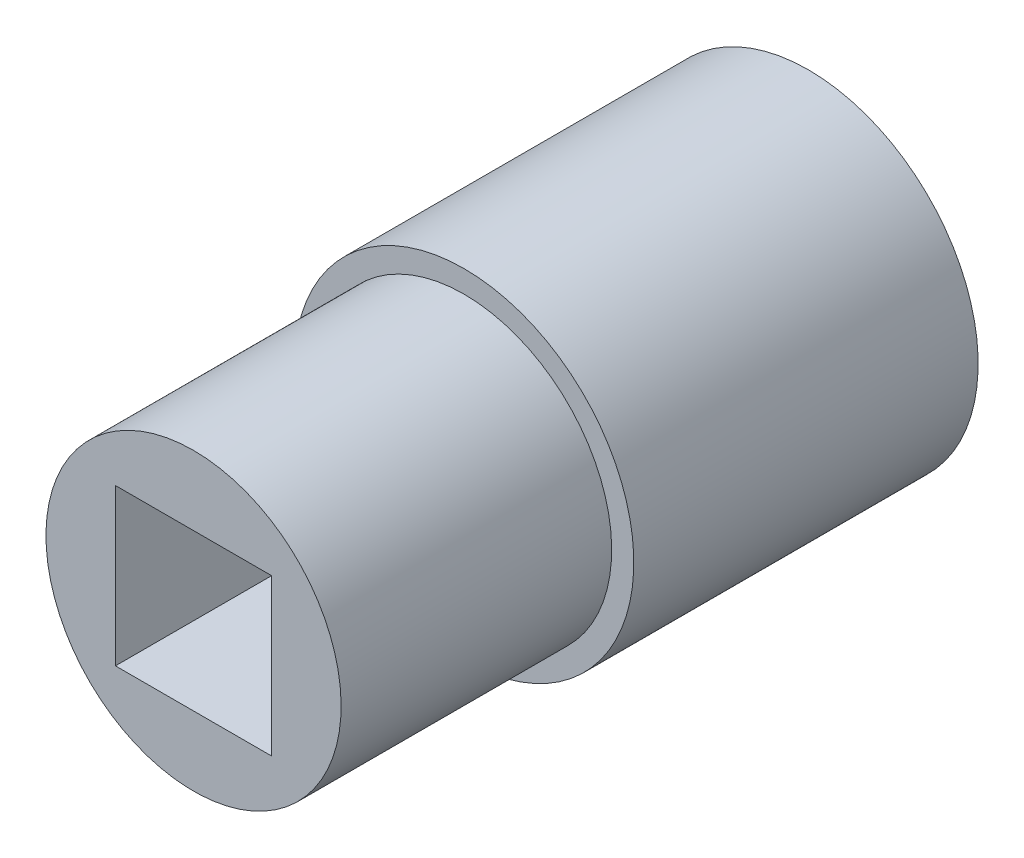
ISO-10303-21;
HEADER;
FILE_DESCRIPTION(('STEP AP214'),'2;1');
FILE_NAME('part.step','',(''),(''),'','','');
FILE_SCHEMA(('AUTOMOTIVE_DESIGN { 1 0 10303 214 1 1 1 1 }'));
ENDSEC;
DATA;
#1=APPLICATION_CONTEXT('core data for automotive mechanical design processes');
#2=APPLICATION_PROTOCOL_DEFINITION('international standard','automotive_design',2000,#1);
#3=PRODUCT_CONTEXT('',#1,'mechanical');
#4=PRODUCT('Part','Part','',(#3));
#5=PRODUCT_RELATED_PRODUCT_CATEGORY('part','',(#4));
#6=PRODUCT_DEFINITION_FORMATION('','',#4);
#7=PRODUCT_DEFINITION_CONTEXT('part definition',#1,'design');
#8=PRODUCT_DEFINITION('design','',#6,#7);
#9=PRODUCT_DEFINITION_SHAPE('','',#8);
#10=(LENGTH_UNIT() NAMED_UNIT(*) SI_UNIT(.MILLI.,.METRE.));
#11=(NAMED_UNIT(*) PLANE_ANGLE_UNIT() SI_UNIT($,.RADIAN.));
#12=(NAMED_UNIT(*) SI_UNIT($,.STERADIAN.) SOLID_ANGLE_UNIT());
#13=UNCERTAINTY_MEASURE_WITH_UNIT(LENGTH_MEASURE(1.E-05),#10,'distance_accuracy_value','');
#14=(GEOMETRIC_REPRESENTATION_CONTEXT(3) GLOBAL_UNCERTAINTY_ASSIGNED_CONTEXT((#13)) GLOBAL_UNIT_ASSIGNED_CONTEXT((#10,
#11,#12)) REPRESENTATION_CONTEXT('',''));
#15=CARTESIAN_POINT('',(0.,0.,0.));
#16=DIRECTION('',(0.,0.,1.));
#17=DIRECTION('',(1.,0.,0.));
#18=AXIS2_PLACEMENT_3D('',#15,#16,#17);
#19=CARTESIAN_POINT('',(0.,0.,0.));
#20=DIRECTION('',(0.,0.,-1.));
#21=DIRECTION('',(0.,1.,0.));
#22=AXIS2_PLACEMENT_3D('',#19,#20,#21);
#23=PLANE('',#22);
#24=DIRECTION('',(0.866025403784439,-0.5,0.));
#25=VECTOR('',#24,1.);
#26=CARTESIAN_POINT('',(0.,5.77350269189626,0.));
#27=LINE('',#26,#25);
#28=CARTESIAN_POINT('',(0.,5.77350269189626,0.));
#29=VERTEX_POINT('',#28);
#30=CARTESIAN_POINT('',(5.,2.88675134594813,0.));
#31=VERTEX_POINT('',#30);
#32=EDGE_CURVE('E36',#29,#31,#27,.T.);
#33=ORIENTED_EDGE('',*,*,#32,.F.);
#34=DIRECTION('',(0.866025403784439,0.5,0.));
#35=VECTOR('',#34,1.);
#36=CARTESIAN_POINT('',(-5.,2.88675134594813,0.));
#37=LINE('',#36,#35);
#38=CARTESIAN_POINT('',(-5.,2.88675134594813,0.));
#39=VERTEX_POINT('',#38);
#40=EDGE_CURVE('E132',#39,#29,#37,.T.);
#41=ORIENTED_EDGE('',*,*,#40,.F.);
#42=DIRECTION('',(0.,1.,0.));
#43=VECTOR('',#42,1.);
#44=CARTESIAN_POINT('',(-5.,-2.88675134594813,0.));
#45=LINE('',#44,#43);
#46=CARTESIAN_POINT('',(-5.,-2.88675134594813,0.));
#47=VERTEX_POINT('',#46);
#48=EDGE_CURVE('E158',#47,#39,#45,.T.);
#49=ORIENTED_EDGE('',*,*,#48,.F.);
#50=DIRECTION('',(-0.866025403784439,0.5,0.));
#51=VECTOR('',#50,1.);
#52=CARTESIAN_POINT('',(0.,-5.77350269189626,0.));
#53=LINE('',#52,#51);
#54=CARTESIAN_POINT('',(0.,-5.77350269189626,0.));
#55=VERTEX_POINT('',#54);
#56=EDGE_CURVE('E155',#55,#47,#53,.T.);
#57=ORIENTED_EDGE('',*,*,#56,.F.);
#58=DIRECTION('',(-0.866025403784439,-0.5,0.));
#59=VECTOR('',#58,1.);
#60=CARTESIAN_POINT('',(5.,-2.88675134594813,0.));
#61=LINE('',#60,#59);
#62=CARTESIAN_POINT('',(5.,-2.88675134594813,0.));
#63=VERTEX_POINT('',#62);
#64=EDGE_CURVE('E152',#63,#55,#61,.T.);
#65=ORIENTED_EDGE('',*,*,#64,.F.);
#66=DIRECTION('',(0.,-1.,0.));
#67=VECTOR('',#66,1.);
#68=CARTESIAN_POINT('',(5.,2.88675134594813,0.));
#69=LINE('',#68,#67);
#70=EDGE_CURVE('E149',#31,#63,#69,.T.);
#71=ORIENTED_EDGE('',*,*,#70,.F.);
#72=EDGE_LOOP('',(#33,#41,#49,#57,#65,#71));
#73=FACE_BOUND('',#72,.T.);
#74=CARTESIAN_POINT('',(0.,0.,0.));
#75=DIRECTION('',(0.,0.,-1.));
#76=DIRECTION('',(0.,1.,0.));
#77=AXIS2_PLACEMENT_3D('',#74,#75,#76);
#78=CIRCLE('',#77,6.9);
#79=CARTESIAN_POINT('',(0.,6.9,0.));
#80=VERTEX_POINT('',#79);
#81=EDGE_CURVE('E9',#80,#80,#78,.T.);
#82=ORIENTED_EDGE('',*,*,#81,.T.);
#83=EDGE_LOOP('',(#82));
#84=FACE_BOUND('',#83,.T.);
#85=ADVANCED_FACE('F14',(#73,#84),#23,.T.);
#86=CARTESIAN_POINT('',(0.,0.,0.));
#87=DIRECTION('',(0.,0.,-1.));
#88=DIRECTION('',(0.,1.,0.));
#89=AXIS2_PLACEMENT_3D('',#86,#87,#88);
#90=CYLINDRICAL_SURFACE('',#89,6.9);
#91=CARTESIAN_POINT('',(0.,0.,14.));
#92=DIRECTION('',(0.,0.,-1.));
#93=DIRECTION('',(0.,1.,0.));
#94=AXIS2_PLACEMENT_3D('',#91,#92,#93);
#95=CIRCLE('',#94,6.9);
#96=CARTESIAN_POINT('',(0.,6.9,14.));
#97=VERTEX_POINT('',#96);
#98=EDGE_CURVE('E21',#97,#97,#95,.T.);
#99=ORIENTED_EDGE('',*,*,#98,.T.);
#100=EDGE_LOOP('',(#99));
#101=FACE_BOUND('',#100,.T.);
#102=ORIENTED_EDGE('',*,*,#81,.F.);
#103=EDGE_LOOP('',(#102));
#104=FACE_BOUND('',#103,.T.);
#105=ADVANCED_FACE('F182',(#101,#104),#90,.T.);
#106=CARTESIAN_POINT('',(6.,0.,14.));
#107=DIRECTION('',(0.,0.,1.));
#108=DIRECTION('',(0.,-1.,0.));
#109=AXIS2_PLACEMENT_3D('',#106,#107,#108);
#110=PLANE('',#109);
#111=CARTESIAN_POINT('',(0.,0.,14.));
#112=DIRECTION('',(0.,0.,-1.));
#113=DIRECTION('',(0.,1.,0.));
#114=AXIS2_PLACEMENT_3D('',#111,#112,#113);
#115=CIRCLE('',#114,6.);
#116=CARTESIAN_POINT('',(0.,6.,14.));
#117=VERTEX_POINT('',#116);
#118=EDGE_CURVE('E177',#117,#117,#115,.T.);
#119=ORIENTED_EDGE('',*,*,#118,.T.);
#120=EDGE_LOOP('',(#119));
#121=FACE_BOUND('',#120,.T.);
#122=ORIENTED_EDGE('',*,*,#98,.F.);
#123=EDGE_LOOP('',(#122));
#124=FACE_BOUND('',#123,.T.);
#125=ADVANCED_FACE('F185',(#121,#124),#110,.T.);
#126=CARTESIAN_POINT('',(0.,0.,0.));
#127=DIRECTION('',(0.,0.,-1.));
#128=DIRECTION('',(0.,1.,0.));
#129=AXIS2_PLACEMENT_3D('',#126,#127,#128);
#130=CYLINDRICAL_SURFACE('',#129,6.);
#131=CARTESIAN_POINT('',(0.,0.,25.));
#132=DIRECTION('',(0.,0.,-1.));
#133=DIRECTION('',(0.,1.,0.));
#134=AXIS2_PLACEMENT_3D('',#131,#132,#133);
#135=CIRCLE('',#134,6.);
#136=CARTESIAN_POINT('',(0.,6.,25.));
#137=VERTEX_POINT('',#136);
#138=EDGE_CURVE('E165',#137,#137,#135,.T.);
#139=ORIENTED_EDGE('',*,*,#138,.T.);
#140=EDGE_LOOP('',(#139));
#141=FACE_BOUND('',#140,.T.);
#142=ORIENTED_EDGE('',*,*,#118,.F.);
#143=EDGE_LOOP('',(#142));
#144=FACE_BOUND('',#143,.T.);
#145=ADVANCED_FACE('F187',(#141,#144),#130,.T.);
#146=CARTESIAN_POINT('',(6.,0.,25.));
#147=DIRECTION('',(0.,0.,1.));
#148=DIRECTION('',(0.,-1.,0.));
#149=AXIS2_PLACEMENT_3D('',#146,#147,#148);
#150=PLANE('',#149);
#151=DIRECTION('',(0.,1.,0.));
#152=VECTOR('',#151,1.);
#153=CARTESIAN_POINT('',(3.175,3.175,25.));
#154=LINE('',#153,#152);
#155=CARTESIAN_POINT('',(3.175,-3.175,25.));
#156=VERTEX_POINT('',#155);
#157=CARTESIAN_POINT('',(3.175,3.175,25.));
#158=VERTEX_POINT('',#157);
#159=EDGE_CURVE('E28',#156,#158,#154,.T.);
#160=ORIENTED_EDGE('',*,*,#159,.F.);
#161=DIRECTION('',(1.,0.,0.));
#162=VECTOR('',#161,1.);
#163=CARTESIAN_POINT('',(-3.175,-3.175,25.));
#164=LINE('',#163,#162);
#165=CARTESIAN_POINT('',(-3.175,-3.175,25.));
#166=VERTEX_POINT('',#165);
#167=EDGE_CURVE('E110',#166,#156,#164,.T.);
#168=ORIENTED_EDGE('',*,*,#167,.F.);
#169=DIRECTION('',(0.,-1.,0.));
#170=VECTOR('',#169,1.);
#171=CARTESIAN_POINT('',(-3.175,3.175,25.));
#172=LINE('',#171,#170);
#173=CARTESIAN_POINT('',(-3.175,3.175,25.));
#174=VERTEX_POINT('',#173);
#175=EDGE_CURVE('E113',#174,#166,#172,.T.);
#176=ORIENTED_EDGE('',*,*,#175,.F.);
#177=DIRECTION('',(-1.,0.,0.));
#178=VECTOR('',#177,1.);
#179=CARTESIAN_POINT('',(-3.175,3.175,25.));
#180=LINE('',#179,#178);
#181=EDGE_CURVE('E119',#158,#174,#180,.T.);
#182=ORIENTED_EDGE('',*,*,#181,.F.);
#183=EDGE_LOOP('',(#160,#168,#176,#182));
#184=FACE_BOUND('',#183,.T.);
#185=ORIENTED_EDGE('',*,*,#138,.F.);
#186=EDGE_LOOP('',(#185));
#187=FACE_BOUND('',#186,.T.);
#188=ADVANCED_FACE('F195',(#184,#187),#150,.T.);
#189=CARTESIAN_POINT('',(0.,5.77350269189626,10.));
#190=DIRECTION('',(0.5,0.866025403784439,0.));
#191=DIRECTION('',(-0.866025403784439,0.5,0.));
#192=AXIS2_PLACEMENT_3D('',#189,#190,#191);
#193=PLANE('',#192);
#194=ORIENTED_EDGE('',*,*,#32,.T.);
#195=DIRECTION('',(0.,0.,-1.));
#196=VECTOR('',#195,1.);
#197=CARTESIAN_POINT('',(5.,2.88675134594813,10.));
#198=LINE('',#197,#196);
#199=CARTESIAN_POINT('',(5.,2.88675134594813,10.));
#200=VERTEX_POINT('',#199);
#201=EDGE_CURVE('E147',#200,#31,#198,.T.);
#202=ORIENTED_EDGE('',*,*,#201,.F.);
#203=DIRECTION('',(0.866025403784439,-0.5,0.));
#204=VECTOR('',#203,1.);
#205=CARTESIAN_POINT('',(0.,5.77350269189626,10.));
#206=LINE('',#205,#204);
#207=CARTESIAN_POINT('',(0.,5.77350269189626,10.));
#208=VERTEX_POINT('',#207);
#209=EDGE_CURVE('E128',#208,#200,#206,.T.);
#210=ORIENTED_EDGE('',*,*,#209,.F.);
#211=DIRECTION('',(0.,0.,-1.));
#212=VECTOR('',#211,1.);
#213=CARTESIAN_POINT('',(0.,5.77350269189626,10.));
#214=LINE('',#213,#212);
#215=EDGE_CURVE('E163',#208,#29,#214,.T.);
#216=ORIENTED_EDGE('',*,*,#215,.T.);
#217=EDGE_LOOP('',(#194,#202,#210,#216));
#218=FACE_BOUND('',#217,.T.);
#219=ADVANCED_FACE('F214',(#218),#193,.F.);
#220=CARTESIAN_POINT('',(-5.,2.88675134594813,10.));
#221=DIRECTION('',(-0.5,0.866025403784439,0.));
#222=DIRECTION('',(-0.866025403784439,-0.5,0.));
#223=AXIS2_PLACEMENT_3D('',#220,#221,#222);
#224=PLANE('',#223);
#225=ORIENTED_EDGE('',*,*,#40,.T.);
#226=ORIENTED_EDGE('',*,*,#215,.F.);
#227=DIRECTION('',(0.866025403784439,0.5,0.));
#228=VECTOR('',#227,1.);
#229=CARTESIAN_POINT('',(-5.,2.88675134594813,10.));
#230=LINE('',#229,#228);
#231=CARTESIAN_POINT('',(-5.,2.88675134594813,10.));
#232=VERTEX_POINT('',#231);
#233=EDGE_CURVE('E144',#232,#208,#230,.T.);
#234=ORIENTED_EDGE('',*,*,#233,.F.);
#235=DIRECTION('',(0.,0.,-1.));
#236=VECTOR('',#235,1.);
#237=CARTESIAN_POINT('',(-5.,2.88675134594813,10.));
#238=LINE('',#237,#236);
#239=EDGE_CURVE('E166',#232,#39,#238,.T.);
#240=ORIENTED_EDGE('',*,*,#239,.T.);
#241=EDGE_LOOP('',(#225,#226,#234,#240));
#242=FACE_BOUND('',#241,.T.);
#243=ADVANCED_FACE('F220',(#242),#224,.F.);
#244=CARTESIAN_POINT('',(-5.,-2.88675134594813,10.));
#245=DIRECTION('',(-1.,0.,0.));
#246=DIRECTION('',(0.,-1.,0.));
#247=AXIS2_PLACEMENT_3D('',#244,#245,#246);
#248=PLANE('',#247);
#249=ORIENTED_EDGE('',*,*,#48,.T.);
#250=ORIENTED_EDGE('',*,*,#239,.F.);
#251=DIRECTION('',(0.,1.,0.));
#252=VECTOR('',#251,1.);
#253=CARTESIAN_POINT('',(-5.,-2.88675134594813,10.));
#254=LINE('',#253,#252);
#255=CARTESIAN_POINT('',(-5.,-2.88675134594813,10.));
#256=VERTEX_POINT('',#255);
#257=EDGE_CURVE('E141',#256,#232,#254,.T.);
#258=ORIENTED_EDGE('',*,*,#257,.F.);
#259=DIRECTION('',(0.,0.,-1.));
#260=VECTOR('',#259,1.);
#261=CARTESIAN_POINT('',(-5.,-2.88675134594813,10.));
#262=LINE('',#261,#260);
#263=EDGE_CURVE('E168',#256,#47,#262,.T.);
#264=ORIENTED_EDGE('',*,*,#263,.T.);
#265=EDGE_LOOP('',(#249,#250,#258,#264));
#266=FACE_BOUND('',#265,.T.);
#267=ADVANCED_FACE('F222',(#266),#248,.F.);
#268=CARTESIAN_POINT('',(0.,-5.77350269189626,10.));
#269=DIRECTION('',(-0.5,-0.866025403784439,0.));
#270=DIRECTION('',(0.866025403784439,-0.5,0.));
#271=AXIS2_PLACEMENT_3D('',#268,#269,#270);
#272=PLANE('',#271);
#273=ORIENTED_EDGE('',*,*,#56,.T.);
#274=ORIENTED_EDGE('',*,*,#263,.F.);
#275=DIRECTION('',(-0.866025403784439,0.5,0.));
#276=VECTOR('',#275,1.);
#277=CARTESIAN_POINT('',(0.,-5.77350269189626,10.));
#278=LINE('',#277,#276);
#279=CARTESIAN_POINT('',(0.,-5.77350269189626,10.));
#280=VERTEX_POINT('',#279);
#281=EDGE_CURVE('E138',#280,#256,#278,.T.);
#282=ORIENTED_EDGE('',*,*,#281,.F.);
#283=DIRECTION('',(0.,0.,-1.));
#284=VECTOR('',#283,1.);
#285=CARTESIAN_POINT('',(0.,-5.77350269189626,10.));
#286=LINE('',#285,#284);
#287=EDGE_CURVE('E170',#280,#55,#286,.T.);
#288=ORIENTED_EDGE('',*,*,#287,.T.);
#289=EDGE_LOOP('',(#273,#274,#282,#288));
#290=FACE_BOUND('',#289,.T.);
#291=ADVANCED_FACE('F224',(#290),#272,.F.);
#292=CARTESIAN_POINT('',(5.,-2.88675134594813,10.));
#293=DIRECTION('',(0.5,-0.866025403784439,0.));
#294=DIRECTION('',(0.866025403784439,0.5,0.));
#295=AXIS2_PLACEMENT_3D('',#292,#293,#294);
#296=PLANE('',#295);
#297=ORIENTED_EDGE('',*,*,#64,.T.);
#298=ORIENTED_EDGE('',*,*,#287,.F.);
#299=DIRECTION('',(-0.866025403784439,-0.5,0.));
#300=VECTOR('',#299,1.);
#301=CARTESIAN_POINT('',(5.,-2.88675134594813,10.));
#302=LINE('',#301,#300);
#303=CARTESIAN_POINT('',(5.,-2.88675134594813,10.));
#304=VERTEX_POINT('',#303);
#305=EDGE_CURVE('E135',#304,#280,#302,.T.);
#306=ORIENTED_EDGE('',*,*,#305,.F.);
#307=DIRECTION('',(0.,0.,-1.));
#308=VECTOR('',#307,1.);
#309=CARTESIAN_POINT('',(5.,-2.88675134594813,10.));
#310=LINE('',#309,#308);
#311=EDGE_CURVE('E172',#304,#63,#310,.T.);
#312=ORIENTED_EDGE('',*,*,#311,.T.);
#313=EDGE_LOOP('',(#297,#298,#306,#312));
#314=FACE_BOUND('',#313,.T.);
#315=ADVANCED_FACE('F227',(#314),#296,.F.);
#316=CARTESIAN_POINT('',(5.,2.88675134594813,10.));
#317=DIRECTION('',(1.,0.,0.));
#318=DIRECTION('',(0.,1.,0.));
#319=AXIS2_PLACEMENT_3D('',#316,#317,#318);
#320=PLANE('',#319);
#321=ORIENTED_EDGE('',*,*,#70,.T.);
#322=ORIENTED_EDGE('',*,*,#311,.F.);
#323=DIRECTION('',(0.,-1.,0.));
#324=VECTOR('',#323,1.);
#325=CARTESIAN_POINT('',(5.,2.88675134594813,10.));
#326=LINE('',#325,#324);
#327=EDGE_CURVE('E131',#200,#304,#326,.T.);
#328=ORIENTED_EDGE('',*,*,#327,.F.);
#329=ORIENTED_EDGE('',*,*,#201,.T.);
#330=EDGE_LOOP('',(#321,#322,#328,#329));
#331=FACE_BOUND('',#330,.T.);
#332=ADVANCED_FACE('F210',(#331),#320,.F.);
#333=CARTESIAN_POINT('',(5.,2.88675134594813,10.));
#334=DIRECTION('',(0.,0.,-1.));
#335=DIRECTION('',(0.,1.,0.));
#336=AXIS2_PLACEMENT_3D('',#333,#334,#335);
#337=PLANE('',#336);
#338=ORIENTED_EDGE('',*,*,#209,.T.);
#339=ORIENTED_EDGE('',*,*,#327,.T.);
#340=ORIENTED_EDGE('',*,*,#305,.T.);
#341=ORIENTED_EDGE('',*,*,#281,.T.);
#342=ORIENTED_EDGE('',*,*,#257,.T.);
#343=ORIENTED_EDGE('',*,*,#233,.T.);
#344=EDGE_LOOP('',(#338,#339,#340,#341,#342,#343));
#345=FACE_BOUND('',#344,.T.);
#346=ADVANCED_FACE('F217',(#345),#337,.T.);
#347=CARTESIAN_POINT('',(3.175,3.175,15.));
#348=DIRECTION('',(1.,0.,0.));
#349=DIRECTION('',(0.,1.,0.));
#350=AXIS2_PLACEMENT_3D('',#347,#348,#349);
#351=PLANE('',#350);
#352=ORIENTED_EDGE('',*,*,#159,.T.);
#353=DIRECTION('',(0.,0.,1.));
#354=VECTOR('',#353,1.);
#355=CARTESIAN_POINT('',(3.175,3.175,15.));
#356=LINE('',#355,#354);
#357=CARTESIAN_POINT('',(3.175,3.175,15.));
#358=VERTEX_POINT('',#357);
#359=EDGE_CURVE('E88',#358,#158,#356,.T.);
#360=ORIENTED_EDGE('',*,*,#359,.F.);
#361=DIRECTION('',(0.,1.,0.));
#362=VECTOR('',#361,1.);
#363=CARTESIAN_POINT('',(3.175,3.175,15.));
#364=LINE('',#363,#362);
#365=CARTESIAN_POINT('',(3.175,-3.175,15.));
#366=VERTEX_POINT('',#365);
#367=EDGE_CURVE('E92',#366,#358,#364,.T.);
#368=ORIENTED_EDGE('',*,*,#367,.F.);
#369=DIRECTION('',(0.,0.,1.));
#370=VECTOR('',#369,1.);
#371=CARTESIAN_POINT('',(3.175,-3.175,15.));
#372=LINE('',#371,#370);
#373=EDGE_CURVE('E123',#366,#156,#372,.T.);
#374=ORIENTED_EDGE('',*,*,#373,.T.);
#375=EDGE_LOOP('',(#352,#360,#368,#374));
#376=FACE_BOUND('',#375,.T.);
#377=ADVANCED_FACE('F90',(#376),#351,.F.);
#378=CARTESIAN_POINT('',(-3.175,-3.175,15.));
#379=DIRECTION('',(0.,-1.,0.));
#380=DIRECTION('',(1.,0.,0.));
#381=AXIS2_PLACEMENT_3D('',#378,#379,#380);
#382=PLANE('',#381);
#383=ORIENTED_EDGE('',*,*,#167,.T.);
#384=ORIENTED_EDGE('',*,*,#373,.F.);
#385=DIRECTION('',(1.,0.,0.));
#386=VECTOR('',#385,1.);
#387=CARTESIAN_POINT('',(-3.175,-3.175,15.));
#388=LINE('',#387,#386);
#389=CARTESIAN_POINT('',(-3.175,-3.175,15.));
#390=VERTEX_POINT('',#389);
#391=EDGE_CURVE('E98',#390,#366,#388,.T.);
#392=ORIENTED_EDGE('',*,*,#391,.F.);
#393=DIRECTION('',(0.,0.,1.));
#394=VECTOR('',#393,1.);
#395=CARTESIAN_POINT('',(-3.175,-3.175,15.));
#396=LINE('',#395,#394);
#397=EDGE_CURVE('E125',#390,#166,#396,.T.);
#398=ORIENTED_EDGE('',*,*,#397,.T.);
#399=EDGE_LOOP('',(#383,#384,#392,#398));
#400=FACE_BOUND('',#399,.T.);
#401=ADVANCED_FACE('F253',(#400),#382,.F.);
#402=CARTESIAN_POINT('',(-3.175,3.175,15.));
#403=DIRECTION('',(-1.,0.,0.));
#404=DIRECTION('',(0.,-1.,0.));
#405=AXIS2_PLACEMENT_3D('',#402,#403,#404);
#406=PLANE('',#405);
#407=ORIENTED_EDGE('',*,*,#175,.T.);
#408=ORIENTED_EDGE('',*,*,#397,.F.);
#409=DIRECTION('',(0.,-1.,0.));
#410=VECTOR('',#409,1.);
#411=CARTESIAN_POINT('',(-3.175,3.175,15.));
#412=LINE('',#411,#410);
#413=CARTESIAN_POINT('',(-3.175,3.175,15.));
#414=VERTEX_POINT('',#413);
#415=EDGE_CURVE('E106',#414,#390,#412,.T.);
#416=ORIENTED_EDGE('',*,*,#415,.F.);
#417=DIRECTION('',(0.,0.,1.));
#418=VECTOR('',#417,1.);
#419=CARTESIAN_POINT('',(-3.175,3.175,15.));
#420=LINE('',#419,#418);
#421=EDGE_CURVE('E97',#414,#174,#420,.T.);
#422=ORIENTED_EDGE('',*,*,#421,.T.);
#423=EDGE_LOOP('',(#407,#408,#416,#422));
#424=FACE_BOUND('',#423,.T.);
#425=ADVANCED_FACE('F251',(#424),#406,.F.);
#426=CARTESIAN_POINT('',(-3.175,3.175,15.));
#427=DIRECTION('',(0.,1.,0.));
#428=DIRECTION('',(-1.,0.,0.));
#429=AXIS2_PLACEMENT_3D('',#426,#427,#428);
#430=PLANE('',#429);
#431=ORIENTED_EDGE('',*,*,#181,.T.);
#432=ORIENTED_EDGE('',*,*,#421,.F.);
#433=DIRECTION('',(-1.,0.,0.));
#434=VECTOR('',#433,1.);
#435=CARTESIAN_POINT('',(-3.175,3.175,15.));
#436=LINE('',#435,#434);
#437=EDGE_CURVE('E101',#358,#414,#436,.T.);
#438=ORIENTED_EDGE('',*,*,#437,.F.);
#439=ORIENTED_EDGE('',*,*,#359,.T.);
#440=EDGE_LOOP('',(#431,#432,#438,#439));
#441=FACE_BOUND('',#440,.T.);
#442=ADVANCED_FACE('F102',(#441),#430,.F.);
#443=CARTESIAN_POINT('',(3.175,-3.175,15.));
#444=DIRECTION('',(0.,0.,1.));
#445=DIRECTION('',(0.,-1.,0.));
#446=AXIS2_PLACEMENT_3D('',#443,#444,#445);
#447=PLANE('',#446);
#448=ORIENTED_EDGE('',*,*,#367,.T.);
#449=ORIENTED_EDGE('',*,*,#437,.T.);
#450=ORIENTED_EDGE('',*,*,#415,.T.);
#451=ORIENTED_EDGE('',*,*,#391,.T.);
#452=EDGE_LOOP('',(#448,#449,#450,#451));
#453=FACE_BOUND('',#452,.T.);
#454=ADVANCED_FACE('F108',(#453),#447,.T.);
#455=CLOSED_SHELL('',(#85,#105,#125,#145,#188,#219,#243,#267,#291,#315,#332,#346,#377,#401,#425,
#442,#454));
#456=MANIFOLD_SOLID_BREP('B1',#455);
#457=ADVANCED_BREP_SHAPE_REPRESENTATION('',(#18,#456),#14);
#458=SHAPE_DEFINITION_REPRESENTATION(#9,#457);
ENDSEC;
END-ISO-10303-21;
